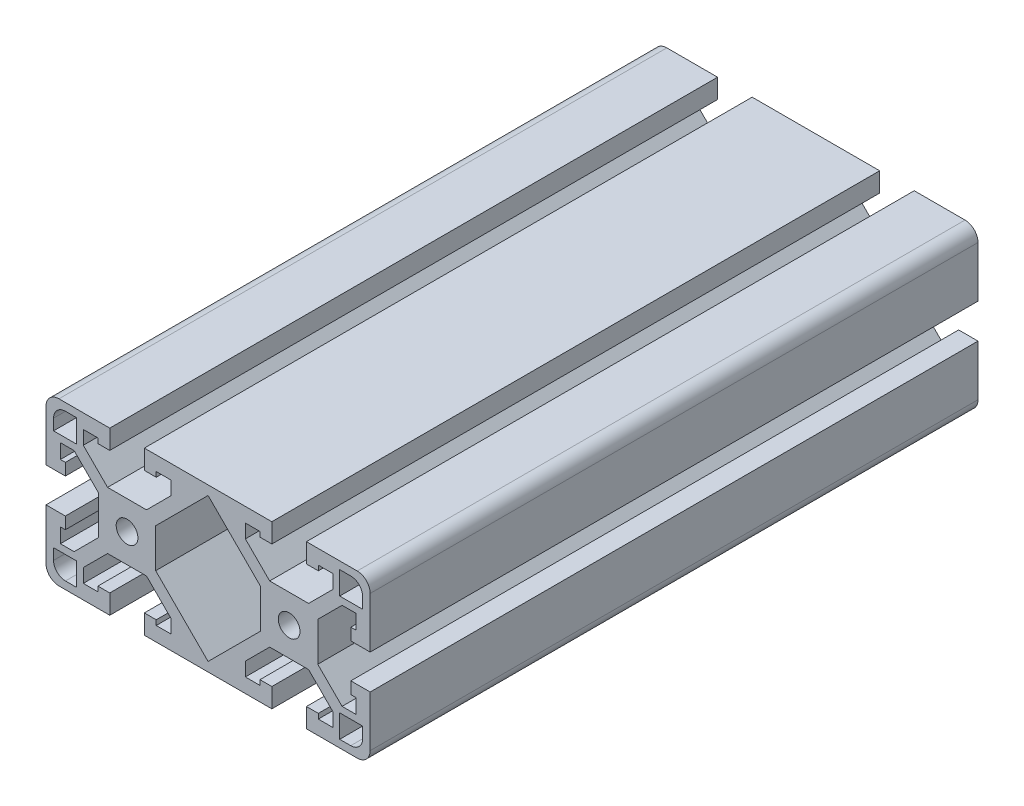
from build123d import *

# Parameters (mm, degrees)
SKETCH1_R           = 2.5527
BOSS_EXTRUDE1_DEPTH = 71.4375


with BuildPart() as part:
    # Sketch1 → Boss-Extrude1 (new, symmetric)
    with BuildSketch(Plane.XY):
        with BuildLine():
            Line((-29.337, 12.442261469), (-29.337, 15.6718))
            Line((-29.337, 15.6718), (-25.908, 15.6718))
            Line((-25.908, 15.6718), (-25.908, 14.5034))
            Line((-25.908, 14.5034), (-23.114, 14.5034))
            Line((-23.114, 14.5034), (-23.114, 19.05))
            Line((-23.114, 19.05), (-35.052, 19.05))
            ThreePointArc((-35.052, 19.05), (-37.207261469, 18.157261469), (-38.1, 16.002))
            Line((-38.1, 16.002), (-38.1, 4.064))
            Line((-38.1, 4.064), (-33.5534, 4.064))
            Line((-33.5534, 4.064), (-33.5534, 6.858))
            Line((-33.5534, 6.858), (-34.7218, 6.858))
            Line((-34.7218, 6.858), (-34.7218, 10.287))
            Line((-34.7218, 10.287), (-31.492261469, 10.287))
            Line((-31.492261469, 10.287), (-25.781, 4.575738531))
            Line((-25.781, 4.575738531), (-25.781, -4.575738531))
            Line((-25.781, -4.575738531), (-31.492261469, -10.287))
            Line((-31.492261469, -10.287), (-34.7218, -10.287))
            Line((-34.7218, -10.287), (-34.7218, -6.858))
            Line((-34.7218, -6.858), (-33.5534, -6.858))
            Line((-33.5534, -6.858), (-33.5534, -4.064))
            Line((-33.5534, -4.064), (-38.1, -4.064))
            Line((-38.1, -4.064), (-38.1, -16.002))
            ThreePointArc((-38.1, -16.002), (-37.207261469, -18.157261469), (-35.052, -19.05))
            Line((-35.052, -19.05), (-23.114, -19.05))
            Line((-23.114, -19.05), (-23.114, -14.5034))
            Line((-23.114, -14.5034), (-25.908, -14.5034))
            Line((-25.908, -14.5034), (-25.908, -15.6718))
            Line((-25.908, -15.6718), (-29.337, -15.6718))
            Line((-29.337, -15.6718), (-29.337, -12.442261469))
            Line((-29.337, -12.442261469), (-23.625738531, -6.731))
            Line((-23.625738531, -6.731), (-14.474261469, -6.731))
            Line((-14.474261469, -6.731), (-8.763, -12.442261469))
            Line((-8.763, -12.442261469), (-8.763, -15.6718))
            Line((-8.763, -15.6718), (-12.192, -15.6718))
            Line((-12.192, -15.6718), (-12.192, -14.5034))
            Line((-12.192, -14.5034), (-14.986, -14.5034))
            Line((-14.986, -14.5034), (-14.986, -19.05))
            Line((-14.986, -19.05), (14.986, -19.05))
            Line((14.986, -19.05), (14.986, -14.5034))
            Line((14.986, -14.5034), (12.192, -14.5034))
            Line((12.192, -14.5034), (12.192, -15.6718))
            Line((12.192, -15.6718), (8.763, -15.6718))
            Line((8.763, -15.6718), (8.763, -12.442261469))
            Line((8.763, -12.442261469), (14.474261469, -6.731))
            Line((14.474261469, -6.731), (23.625738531, -6.731))
            Line((23.625738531, -6.731), (29.337, -12.442261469))
            Line((29.337, -12.442261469), (29.337, -15.6718))
            Line((29.337, -15.6718), (25.908, -15.6718))
            Line((25.908, -15.6718), (25.908, -14.5034))
            Line((25.908, -14.5034), (23.114, -14.5034))
            Line((23.114, -14.5034), (23.114, -19.05))
            Line((23.114, -19.05), (35.052, -19.05))
            ThreePointArc((35.052, -19.05), (37.207261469, -18.157261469), (38.1, -16.002))
            Line((38.1, -16.002), (38.1, -4.064))
            Line((38.1, -4.064), (33.5534, -4.064))
            Line((33.5534, -4.064), (33.5534, -6.858))
            Line((33.5534, -6.858), (34.7218, -6.858))
            Line((34.7218, -6.858), (34.7218, -10.287))
            Line((34.7218, -10.287), (31.492261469, -10.287))
            Line((31.492261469, -10.287), (25.781, -4.575738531))
            Line((25.781, -4.575738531), (25.781, 4.575738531))
            Line((25.781, 4.575738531), (31.492261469, 10.287))
            Line((31.492261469, 10.287), (34.7218, 10.287))
            Line((34.7218, 10.287), (34.7218, 6.858))
            Line((34.7218, 6.858), (33.5534, 6.858))
            Line((33.5534, 6.858), (33.5534, 4.064))
            Line((33.5534, 4.064), (38.1, 4.064))
            Line((38.1, 4.064), (38.1, 16.002))
            ThreePointArc((38.1, 16.002), (37.207261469, 18.157261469), (35.052, 19.05))
            Line((35.052, 19.05), (23.114, 19.05))
            Line((23.114, 19.05), (23.114, 14.5034))
            Line((23.114, 14.5034), (25.908, 14.5034))
            Line((25.908, 14.5034), (25.908, 15.6718))
            Line((25.908, 15.6718), (29.337, 15.6718))
            Line((29.337, 15.6718), (29.337, 12.442261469))
            Line((29.337, 12.442261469), (23.625738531, 6.731))
            Line((23.625738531, 6.731), (14.474261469, 6.731))
            Line((14.474261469, 6.731), (8.763, 12.442261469))
            Line((8.763, 12.442261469), (8.763, 15.6718))
            Line((8.763, 15.6718), (12.192, 15.6718))
            Line((12.192, 15.6718), (12.192, 14.5034))
            Line((12.192, 14.5034), (14.986, 14.5034))
            Line((14.986, 14.5034), (14.986, 19.05))
            Line((14.986, 19.05), (-14.986, 19.05))
            Line((-14.986, 19.05), (-14.986, 14.5034))
            Line((-14.986, 14.5034), (-12.192, 14.5034))
            Line((-12.192, 14.5034), (-12.192, 15.6718))
            Line((-12.192, 15.6718), (-8.763, 15.6718))
            Line((-8.763, 15.6718), (-8.763, 12.442261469))
            Line((-8.763, 12.442261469), (-14.474261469, 6.731))
            Line((-14.474261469, 6.731), (-23.625738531, 6.731))
            Line((-23.625738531, 6.731), (-29.337, 12.442261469))
        make_face()
        with Locations((-19.05, 0)):
            Circle(SKETCH1_R, mode=Mode.SUBTRACT)
        with Locations((19.05, 0)):
            Circle(SKETCH1_R, mode=Mode.SUBTRACT)
        Polygon((-12.319, 4.575738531), (-12.319, -4.575738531), (0, -16.894738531), (12.319, -4.575738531), (12.319, 4.575738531), (0, 16.894738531), align=None, mode=Mode.SUBTRACT)
        with BuildLine():
            Line((-30.9372, 11.8872), (-30.9372, 17.272))
            Line((-30.9372, 17.272), (-33.528, 17.272))
            ThreePointArc((-33.528, 17.272), (-35.503656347, 16.453656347), (-36.322, 14.478))
            Line((-36.322, 14.478), (-36.322, 11.8872))
            Line((-36.322, 11.8872), (-30.9372, 11.8872))
        make_face(mode=Mode.SUBTRACT)
        with BuildLine():
            Line((-30.9372, -17.272), (-30.9372, -11.8872))
            Line((-30.9372, -11.8872), (-36.322, -11.8872))
            Line((-36.322, -11.8872), (-36.322, -14.478))
            ThreePointArc((-36.322, -14.478), (-35.503656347, -16.453656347), (-33.528, -17.272))
            Line((-33.528, -17.272), (-30.9372, -17.272))
        make_face(mode=Mode.SUBTRACT)
        with BuildLine():
            Line((36.322, -11.8872), (30.9372, -11.8872))
            Line((30.9372, -11.8872), (30.9372, -17.272))
            Line((30.9372, -17.272), (33.528, -17.272))
            ThreePointArc((33.528, -17.272), (35.503656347, -16.453656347), (36.322, -14.478))
            Line((36.322, -14.478), (36.322, -11.8872))
        make_face(mode=Mode.SUBTRACT)
        with BuildLine():
            Line((30.9372, 17.272), (30.9372, 11.8872))
            Line((30.9372, 11.8872), (36.322, 11.8872))
            Line((36.322, 11.8872), (36.322, 14.478))
            ThreePointArc((36.322, 14.478), (35.503656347, 16.453656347), (33.528, 17.272))
            Line((33.528, 17.272), (30.9372, 17.272))
        make_face(mode=Mode.SUBTRACT)
    extrude(amount=BOSS_EXTRUDE1_DEPTH, both=True)


solid = part.part
